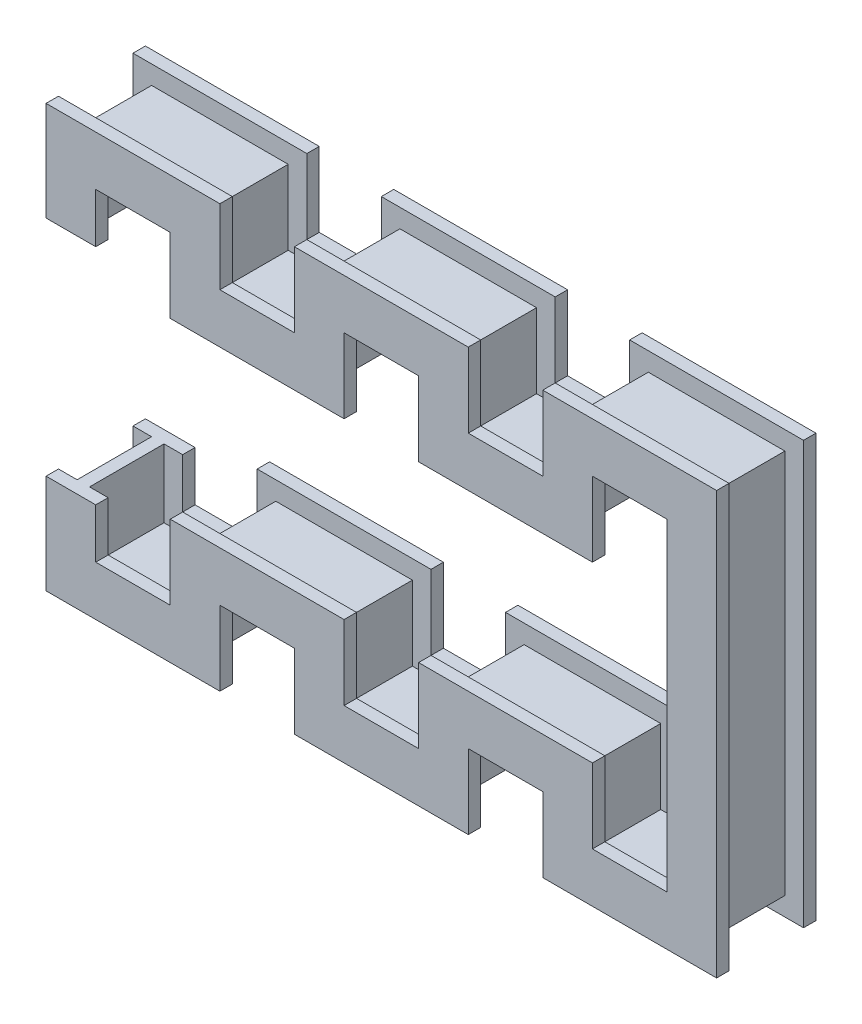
from build123d import *


with BuildPart() as part:
    # Sweep1: sweep along a path in Sketch1
    with BuildLine(Plane.XY) as sweep1_path:
        Line((-136.190738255, 0), (-136.190738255, 60))
        Line((-136.190738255, 60), (-36.190738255, 60))
        Line((-36.190738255, 60), (-36.190738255, 0))
        Line((-36.190738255, 0), (63.809261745, 0))
        Line((63.809261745, 0), (63.809261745, 60))
        Line((63.809261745, 60), (163.809261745, 60))
        Line((163.809261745, 60), (163.809261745, 0))
        Line((163.809261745, 0), (263.809261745, 0))
        Line((263.809261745, 0), (263.809261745, 60))
        Line((263.809261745, 60), (363.809261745, 60))
        Line((363.809261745, 60), (363.809261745, -240))
        Line((363.809261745, -240), (263.809261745, -240))
        Line((263.809261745, -240), (263.809261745, -180))
        Line((263.809261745, -180), (163.809261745, -180))
        Line((163.809261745, -180), (163.809261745, -240))
        Line((163.809261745, -240), (63.809261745, -240))
        Line((63.809261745, -240), (63.809261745, -180))
        Line((63.809261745, -180), (-36.190738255, -180))
        Line((-36.190738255, -180), (-36.190738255, -240))
        Line((-36.190738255, -240), (-136.190738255, -240))
        Line((-136.190738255, -240), (-136.190738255, -180))
    # Sketch2 → Sweep1 (sweep)
    with BuildSketch(Plane(origin=(-136.190738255, 0, 0), x_dir=(0, 0, 1), z_dir=(0, 1, 0))):
        Polygon((-30, 5), (30, 5), (30, 20), (40, 20), (40, -20), (30, -20), (30, -5), (-30, -5), (-30, -20), (-40, -20), (-40, 20), (-30, 20), align=None)
    sweep(path=sweep1_path.line, transition=Transition.RIGHT)


solid = part.part
